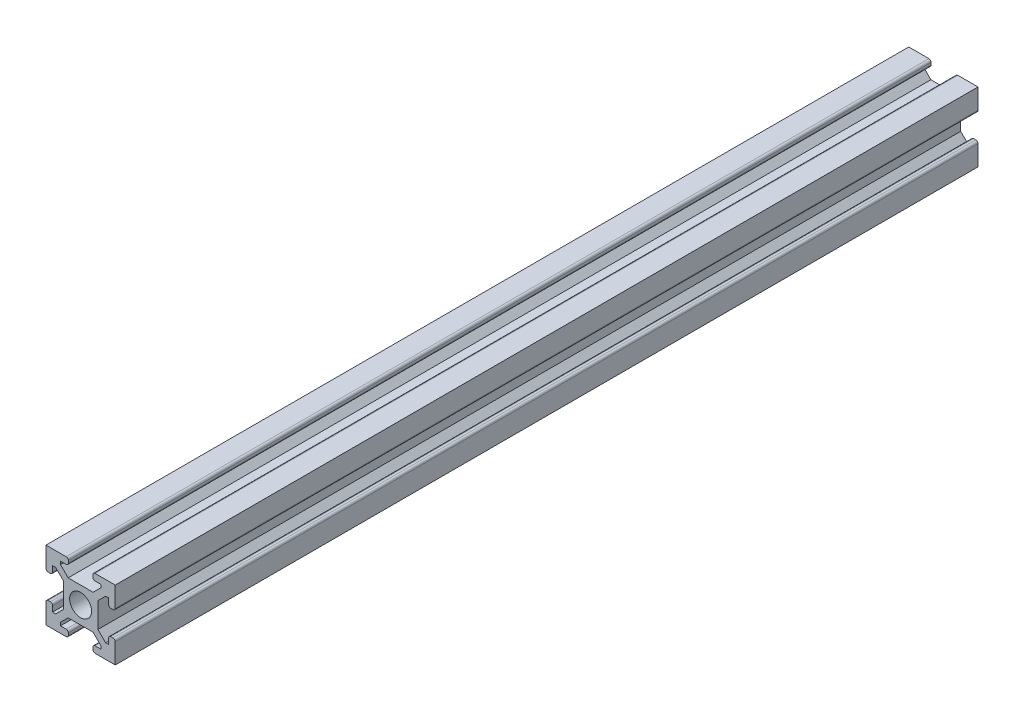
from build123d import *

# Parameters (mm, degrees)
SKETCH1_W           = 20.066
SKETCH1_H           = 20.066
SKETCH1_R           = 6.35
BOSS_EXTRUDE1_DEPTH = 499.999
FILLET1_R           = 1.27


with BuildPart() as part:
    # Sketch1 → Boss-Extrude1 (new body)
    # profile 1 of 5: a face of its own
    with BuildSketch(Plane.XY):
        Polygon((-7.10421319, 16.256), (-7.10421319, 20.066), (-20.066, 20.066), (-20.066, 7.10421319), (-16.256, 7.10421319), (-16.256, 11.67621319), (-14.478, 11.67621319), (-10.033, 7.23121319), (-10.033, 10.033), (-7.23121319, 10.033), (-11.67621319, 14.478), (-11.67621319, 16.256), align=None)
    # profile 2 of 5: a face of its own
    with BuildSketch(Plane.XY):
        Polygon((20.066, 20.066), (7.10421319, 20.066), (7.10421319, 16.256), (11.67621319, 16.256), (11.67621319, 14.478), (7.23121319, 10.033), (10.033, 10.033), (10.033, 7.23121319), (14.478, 11.67621319), (16.256, 11.67621319), (16.256, 7.10421319), (20.066, 7.10421319), align=None)
    # profile 3 of 5: a face of its own
    with BuildSketch(Plane.XY):
        Rectangle(SKETCH1_W, SKETCH1_H)
        with Locations(Location((0, 0, 0), (0, 0, 180))):
            Circle(SKETCH1_R, mode=Mode.SUBTRACT)
    # profile 4 of 5: a face of its own
    with BuildSketch(Plane.XY):
        Polygon((20.066, -20.066), (20.066, -7.10421319), (16.256, -7.10421319), (16.256, -11.67621319), (14.478, -11.67621319), (10.033, -7.23121319), (10.033, -10.033), (7.23121319, -10.033), (11.67621319, -14.478), (11.67621319, -16.256), (7.10421319, -16.256), (7.10421319, -20.066), align=None)
    # profile 5 of 5: a face of its own
    with BuildSketch(Plane.XY):
        Polygon((-16.256, -7.10421319), (-20.066, -7.10421319), (-20.066, -20.066), (-7.10421319, -20.066), (-7.10421319, -16.256), (-11.67621319, -16.256), (-11.67621319, -14.478), (-7.23121319, -10.033), (-10.033, -10.033), (-10.033, -7.23121319), (-14.478, -11.67621319), (-16.256, -11.67621319), align=None)
    extrude(amount=BOSS_EXTRUDE1_DEPTH)

    # Fillet1
    fillet1_edges = [part.edges().sort_by_distance(p)[0] for p in [
        (16.256, -7.10421319, 249.9995),
        (20.066, -7.10421319, 249.9995),
        (7.10421319, -20.066, 249.9995),
        (7.10421319, -16.256, 249.9995),
        (-7.10421319, -16.256, 249.9995),
        (-7.10421319, -20.066, 249.9995),
        (-20.066, -7.10421319, 249.9995),
        (-16.256, -7.10421319, 249.9995),
        (-16.256, 7.10421319, 249.9995),
        (-20.066, 7.10421319, 249.9995),
        (-7.10421319, 20.066, 249.9995),
        (-7.10421319, 16.256, 249.9995),
        (7.10421319, 16.256, 249.9995),
        (7.10421319, 20.066, 249.9995),
        (20.066, 7.10421319, 249.9995),
        (16.256, 7.10421319, 249.9995),
    ]]
    fillet(fillet1_edges, radius=FILLET1_R)


solid = part.part
